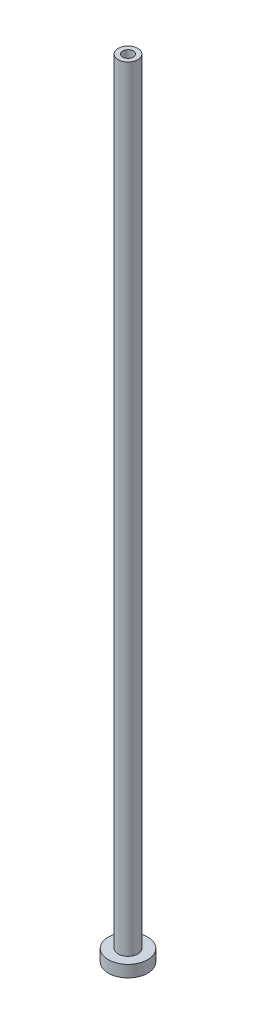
ISO-10303-21;
HEADER;
FILE_DESCRIPTION(('STEP AP214'),'2;1');
FILE_NAME('part.step','',(''),(''),'','','');
FILE_SCHEMA(('AUTOMOTIVE_DESIGN { 1 0 10303 214 1 1 1 1 }'));
ENDSEC;
DATA;
#1=APPLICATION_CONTEXT('core data for automotive mechanical design processes');
#2=APPLICATION_PROTOCOL_DEFINITION('international standard','automotive_design',2000,#1);
#3=PRODUCT_CONTEXT('',#1,'mechanical');
#4=PRODUCT('Part','Part','',(#3));
#5=PRODUCT_RELATED_PRODUCT_CATEGORY('part','',(#4));
#6=PRODUCT_DEFINITION_FORMATION('','',#4);
#7=PRODUCT_DEFINITION_CONTEXT('part definition',#1,'design');
#8=PRODUCT_DEFINITION('design','',#6,#7);
#9=PRODUCT_DEFINITION_SHAPE('','',#8);
#10=(LENGTH_UNIT() NAMED_UNIT(*) SI_UNIT(.MILLI.,.METRE.));
#11=(NAMED_UNIT(*) PLANE_ANGLE_UNIT() SI_UNIT($,.RADIAN.));
#12=(NAMED_UNIT(*) SI_UNIT($,.STERADIAN.) SOLID_ANGLE_UNIT());
#13=UNCERTAINTY_MEASURE_WITH_UNIT(LENGTH_MEASURE(1.E-05),#10,'distance_accuracy_value','');
#14=(GEOMETRIC_REPRESENTATION_CONTEXT(3) GLOBAL_UNCERTAINTY_ASSIGNED_CONTEXT((#13)) GLOBAL_UNIT_ASSIGNED_CONTEXT((#10,
#11,#12)) REPRESENTATION_CONTEXT('',''));
#15=CARTESIAN_POINT('',(0.,0.,0.));
#16=DIRECTION('',(0.,0.,1.));
#17=DIRECTION('',(1.,0.,0.));
#18=AXIS2_PLACEMENT_3D('',#15,#16,#17);
#19=CARTESIAN_POINT('',(0.,0.,0.));
#20=DIRECTION('',(0.,-1.,0.));
#21=DIRECTION('',(0.,0.,-1.));
#22=AXIS2_PLACEMENT_3D('',#19,#20,#21);
#23=CYLINDRICAL_SURFACE('',#22,5.);
#24=CARTESIAN_POINT('',(0.,-3.,0.));
#25=DIRECTION('',(0.,-1.,0.));
#26=DIRECTION('',(0.,0.,-1.));
#27=AXIS2_PLACEMENT_3D('',#24,#25,#26);
#28=CIRCLE('',#27,5.);
#29=CARTESIAN_POINT('',(0.,-3.,-5.));
#30=VERTEX_POINT('',#29);
#31=EDGE_CURVE('E59',#30,#30,#28,.T.);
#32=ORIENTED_EDGE('',*,*,#31,.F.);
#33=EDGE_LOOP('',(#32));
#34=FACE_BOUND('',#33,.T.);
#35=CARTESIAN_POINT('',(0.,0.,0.));
#36=DIRECTION('',(0.,-1.,0.));
#37=DIRECTION('',(0.,0.,-1.));
#38=AXIS2_PLACEMENT_3D('',#35,#36,#37);
#39=CIRCLE('',#38,5.);
#40=CARTESIAN_POINT('',(0.,0.,-5.));
#41=VERTEX_POINT('',#40);
#42=EDGE_CURVE('E10',#41,#41,#39,.T.);
#43=ORIENTED_EDGE('',*,*,#42,.T.);
#44=EDGE_LOOP('',(#43));
#45=FACE_BOUND('',#44,.T.);
#46=ADVANCED_FACE('F31',(#34,#45),#23,.T.);
#47=CARTESIAN_POINT('',(-5.,0.,0.));
#48=DIRECTION('',(0.,-1.,0.));
#49=DIRECTION('',(0.,0.,-1.));
#50=AXIS2_PLACEMENT_3D('',#47,#48,#49);
#51=PLANE('',#50);
#52=ORIENTED_EDGE('',*,*,#42,.F.);
#53=EDGE_LOOP('',(#52));
#54=FACE_BOUND('',#53,.T.);
#55=CARTESIAN_POINT('',(0.,0.,0.));
#56=DIRECTION('',(0.,-1.,0.));
#57=DIRECTION('',(0.,0.,-1.));
#58=AXIS2_PLACEMENT_3D('',#55,#56,#57);
#59=CIRCLE('',#58,2.5);
#60=CARTESIAN_POINT('',(0.,0.,-2.5));
#61=VERTEX_POINT('',#60);
#62=EDGE_CURVE('E37',#61,#61,#59,.T.);
#63=ORIENTED_EDGE('',*,*,#62,.T.);
#64=EDGE_LOOP('',(#63));
#65=FACE_BOUND('',#64,.T.);
#66=ADVANCED_FACE('F66',(#54,#65),#51,.F.);
#67=CARTESIAN_POINT('',(0.,0.,0.));
#68=DIRECTION('',(0.,-1.,0.));
#69=DIRECTION('',(0.,0.,-1.));
#70=AXIS2_PLACEMENT_3D('',#67,#68,#69);
#71=CYLINDRICAL_SURFACE('',#70,2.5);
#72=ORIENTED_EDGE('',*,*,#62,.F.);
#73=EDGE_LOOP('',(#72));
#74=FACE_BOUND('',#73,.T.);
#75=CARTESIAN_POINT('',(0.,197.,0.));
#76=DIRECTION('',(0.,-1.,0.));
#77=DIRECTION('',(0.,0.,-1.));
#78=AXIS2_PLACEMENT_3D('',#75,#76,#77);
#79=CIRCLE('',#78,2.5);
#80=CARTESIAN_POINT('',(0.,197.,-2.5));
#81=VERTEX_POINT('',#80);
#82=EDGE_CURVE('E41',#81,#81,#79,.T.);
#83=ORIENTED_EDGE('',*,*,#82,.T.);
#84=EDGE_LOOP('',(#83));
#85=FACE_BOUND('',#84,.T.);
#86=ADVANCED_FACE('F70',(#74,#85),#71,.T.);
#87=CARTESIAN_POINT('',(-2.5,197.,0.));
#88=DIRECTION('',(0.,-1.,0.));
#89=DIRECTION('',(0.,0.,-1.));
#90=AXIS2_PLACEMENT_3D('',#87,#88,#89);
#91=PLANE('',#90);
#92=ORIENTED_EDGE('',*,*,#82,.F.);
#93=EDGE_LOOP('',(#92));
#94=FACE_BOUND('',#93,.T.);
#95=CARTESIAN_POINT('',(0.,197.,0.));
#96=DIRECTION('',(0.,-1.,0.));
#97=DIRECTION('',(0.,0.,-1.));
#98=AXIS2_PLACEMENT_3D('',#95,#96,#97);
#99=CIRCLE('',#98,1.35);
#100=CARTESIAN_POINT('',(0.,197.,-1.35));
#101=VERTEX_POINT('',#100);
#102=EDGE_CURVE('E45',#101,#101,#99,.T.);
#103=ORIENTED_EDGE('',*,*,#102,.T.);
#104=EDGE_LOOP('',(#103));
#105=FACE_BOUND('',#104,.T.);
#106=ADVANCED_FACE('F75',(#94,#105),#91,.F.);
#107=CARTESIAN_POINT('',(0.,0.,0.));
#108=DIRECTION('',(0.,-1.,0.));
#109=DIRECTION('',(0.,0.,-1.));
#110=AXIS2_PLACEMENT_3D('',#107,#108,#109);
#111=CYLINDRICAL_SURFACE('',#110,1.35);
#112=ORIENTED_EDGE('',*,*,#102,.F.);
#113=EDGE_LOOP('',(#112));
#114=FACE_BOUND('',#113,.T.);
#115=CARTESIAN_POINT('',(0.,152.,0.));
#116=DIRECTION('',(0.,-1.,0.));
#117=DIRECTION('',(0.,0.,-1.));
#118=AXIS2_PLACEMENT_3D('',#115,#116,#117);
#119=CIRCLE('',#118,1.35);
#120=CARTESIAN_POINT('',(0.,152.,-1.35));
#121=VERTEX_POINT('',#120);
#122=EDGE_CURVE('E50',#121,#121,#119,.T.);
#123=ORIENTED_EDGE('',*,*,#122,.T.);
#124=EDGE_LOOP('',(#123));
#125=FACE_BOUND('',#124,.T.);
#126=ADVANCED_FACE('F81',(#114,#125),#111,.F.);
#127=CARTESIAN_POINT('',(0.,151.85,0.));
#128=DIRECTION('',(0.,-1.,0.));
#129=DIRECTION('',(0.,0.,-1.));
#130=AXIS2_PLACEMENT_3D('',#127,#128,#129);
#131=CONICAL_SURFACE('',#130,1.5,0.785398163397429);
#132=ORIENTED_EDGE('',*,*,#122,.F.);
#133=EDGE_LOOP('',(#132));
#134=FACE_BOUND('',#133,.T.);
#135=CARTESIAN_POINT('',(0.,151.85,0.));
#136=DIRECTION('',(0.,-1.,0.));
#137=DIRECTION('',(0.,0.,-1.));
#138=AXIS2_PLACEMENT_3D('',#135,#136,#137);
#139=CIRCLE('',#138,1.5);
#140=CARTESIAN_POINT('',(0.,151.85,-1.5));
#141=VERTEX_POINT('',#140);
#142=EDGE_CURVE('E53',#141,#141,#139,.T.);
#143=ORIENTED_EDGE('',*,*,#142,.T.);
#144=EDGE_LOOP('',(#143));
#145=FACE_BOUND('',#144,.T.);
#146=ADVANCED_FACE('F85',(#134,#145),#131,.F.);
#147=CARTESIAN_POINT('',(0.,0.,0.));
#148=DIRECTION('',(0.,-1.,0.));
#149=DIRECTION('',(0.,0.,-1.));
#150=AXIS2_PLACEMENT_3D('',#147,#148,#149);
#151=CYLINDRICAL_SURFACE('',#150,1.5);
#152=ORIENTED_EDGE('',*,*,#142,.F.);
#153=EDGE_LOOP('',(#152));
#154=FACE_BOUND('',#153,.T.);
#155=CARTESIAN_POINT('',(0.,-3.,0.));
#156=DIRECTION('',(0.,-1.,0.));
#157=DIRECTION('',(0.,0.,-1.));
#158=AXIS2_PLACEMENT_3D('',#155,#156,#157);
#159=CIRCLE('',#158,1.5);
#160=CARTESIAN_POINT('',(0.,-3.,-1.5));
#161=VERTEX_POINT('',#160);
#162=EDGE_CURVE('E56',#161,#161,#159,.T.);
#163=ORIENTED_EDGE('',*,*,#162,.T.);
#164=EDGE_LOOP('',(#163));
#165=FACE_BOUND('',#164,.T.);
#166=ADVANCED_FACE('F89',(#154,#165),#151,.F.);
#167=CARTESIAN_POINT('',(-1.5,-3.,0.));
#168=DIRECTION('',(0.,1.,0.));
#169=DIRECTION('',(0.,0.,1.));
#170=AXIS2_PLACEMENT_3D('',#167,#168,#169);
#171=PLANE('',#170);
#172=ORIENTED_EDGE('',*,*,#162,.F.);
#173=EDGE_LOOP('',(#172));
#174=FACE_BOUND('',#173,.T.);
#175=ORIENTED_EDGE('',*,*,#31,.T.);
#176=EDGE_LOOP('',(#175));
#177=FACE_BOUND('',#176,.T.);
#178=ADVANCED_FACE('F63',(#174,#177),#171,.F.);
#179=CLOSED_SHELL('',(#46,#66,#86,#106,#126,#146,#166,#178));
#180=MANIFOLD_SOLID_BREP('B2',#179);
#181=ADVANCED_BREP_SHAPE_REPRESENTATION('',(#18,#180),#14);
#182=SHAPE_DEFINITION_REPRESENTATION(#9,#181);
ENDSEC;
END-ISO-10303-21;
